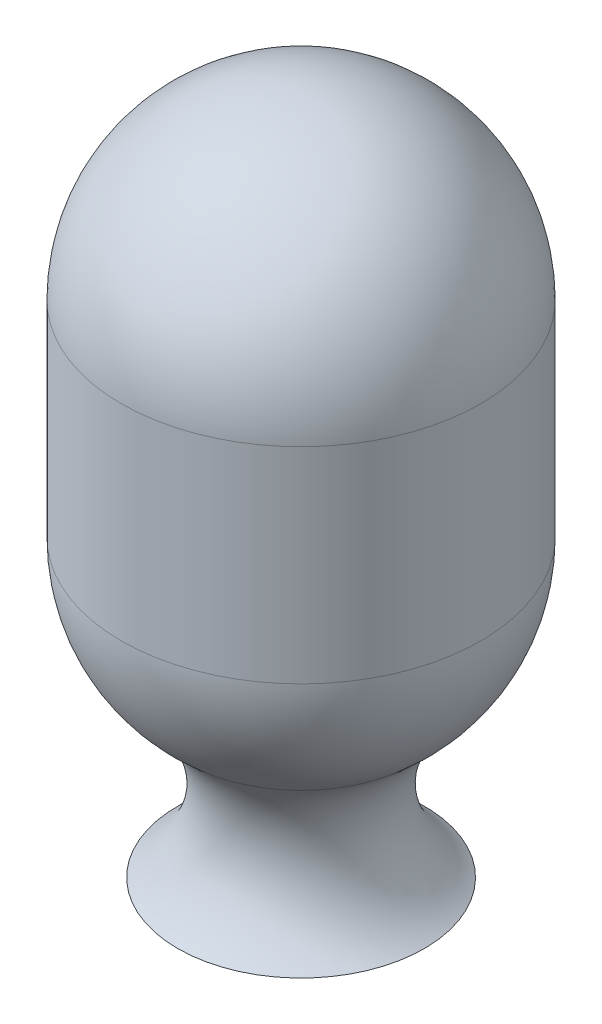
ISO-10303-21;
HEADER;
FILE_DESCRIPTION(('STEP AP214'),'2;1');
FILE_NAME('part.step','',(''),(''),'','','');
FILE_SCHEMA(('AUTOMOTIVE_DESIGN { 1 0 10303 214 1 1 1 1 }'));
ENDSEC;
DATA;
#1=APPLICATION_CONTEXT('core data for automotive mechanical design processes');
#2=APPLICATION_PROTOCOL_DEFINITION('international standard','automotive_design',2000,#1);
#3=PRODUCT_CONTEXT('',#1,'mechanical');
#4=PRODUCT('Part','Part','',(#3));
#5=PRODUCT_RELATED_PRODUCT_CATEGORY('part','',(#4));
#6=PRODUCT_DEFINITION_FORMATION('','',#4);
#7=PRODUCT_DEFINITION_CONTEXT('part definition',#1,'design');
#8=PRODUCT_DEFINITION('design','',#6,#7);
#9=PRODUCT_DEFINITION_SHAPE('','',#8);
#10=(LENGTH_UNIT() NAMED_UNIT(*) SI_UNIT(.MILLI.,.METRE.));
#11=(NAMED_UNIT(*) PLANE_ANGLE_UNIT() SI_UNIT($,.RADIAN.));
#12=(NAMED_UNIT(*) SI_UNIT($,.STERADIAN.) SOLID_ANGLE_UNIT());
#13=UNCERTAINTY_MEASURE_WITH_UNIT(LENGTH_MEASURE(1.E-05),#10,'distance_accuracy_value','');
#14=(GEOMETRIC_REPRESENTATION_CONTEXT(3) GLOBAL_UNCERTAINTY_ASSIGNED_CONTEXT((#13)) GLOBAL_UNIT_ASSIGNED_CONTEXT((#10,
#11,#12)) REPRESENTATION_CONTEXT('',''));
#15=CARTESIAN_POINT('',(0.,0.,0.));
#16=DIRECTION('',(0.,0.,1.));
#17=DIRECTION('',(1.,0.,0.));
#18=AXIS2_PLACEMENT_3D('',#15,#16,#17);
#19=CARTESIAN_POINT('',(18.0000092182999,17.3657061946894,0.));
#20=DIRECTION('',(0.,1.,0.));
#21=DIRECTION('',(0.,0.,1.));
#22=AXIS2_PLACEMENT_3D('',#19,#20,#21);
#23=TOROIDAL_SURFACE('',#22,7.20000000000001,3.96888370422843);
#24=CARTESIAN_POINT('',(18.0000092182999,20.3998361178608,0.));
#25=DIRECTION('',(0.,-1.,0.));
#26=DIRECTION('',(0.,0.,-1.));
#27=AXIS2_PLACEMENT_3D('',#24,#25,#26);
#28=CIRCLE('',#27,4.64146653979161);
#29=CARTESIAN_POINT('',(18.0000092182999,20.3998361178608,-4.64146653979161));
#30=VERTEX_POINT('',#29);
#31=EDGE_CURVE('E58',#30,#30,#28,.T.);
#32=ORIENTED_EDGE('',*,*,#31,.T.);
#33=EDGE_LOOP('',(#32));
#34=FACE_BOUND('',#33,.T.);
#35=CARTESIAN_POINT('',(18.0000092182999,14.1011308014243,0.));
#36=DIRECTION('',(0.,1.,0.));
#37=DIRECTION('',(0.,0.,1.));
#38=AXIS2_PLACEMENT_3D('',#35,#36,#37);
#39=CIRCLE('',#38,4.94288118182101);
#40=CARTESIAN_POINT('',(18.0000092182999,14.1011308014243,4.94288118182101));
#41=VERTEX_POINT('',#40);
#42=EDGE_CURVE('E68',#41,#41,#39,.T.);
#43=ORIENTED_EDGE('',*,*,#42,.T.);
#44=EDGE_LOOP('',(#43));
#45=FACE_BOUND('',#44,.T.);
#46=ADVANCED_FACE('F46',(#34,#45),#23,.F.);
#47=CARTESIAN_POINT('',(18.0000092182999,41.3345898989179,0.));
#48=DIRECTION('',(0.,1.,0.));
#49=DIRECTION('',(0.,0.,1.));
#50=AXIS2_PLACEMENT_3D('',#47,#48,#49);
#51=CYLINDRICAL_SURFACE('',#50,7.20000000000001);
#52=CARTESIAN_POINT('',(18.0000092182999,25.9040879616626,0.));
#53=DIRECTION('',(0.,1.,0.));
#54=DIRECTION('',(0.,0.,1.));
#55=AXIS2_PLACEMENT_3D('',#52,#53,#54);
#56=CIRCLE('',#55,7.20000000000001);
#57=CARTESIAN_POINT('',(18.0000092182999,25.9040879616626,7.20000000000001));
#58=VERTEX_POINT('',#57);
#59=EDGE_CURVE('E62',#58,#58,#56,.T.);
#60=ORIENTED_EDGE('',*,*,#59,.T.);
#61=EDGE_LOOP('',(#60));
#62=FACE_BOUND('',#61,.T.);
#63=CARTESIAN_POINT('',(18.0000092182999,34.1345898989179,0.));
#64=DIRECTION('',(0.,1.,0.));
#65=DIRECTION('',(0.,0.,1.));
#66=AXIS2_PLACEMENT_3D('',#63,#64,#65);
#67=CIRCLE('',#66,7.20000000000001);
#68=CARTESIAN_POINT('',(18.0000092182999,34.1345898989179,7.20000000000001));
#69=VERTEX_POINT('',#68);
#70=EDGE_CURVE('E65',#69,#69,#67,.F.);
#71=ORIENTED_EDGE('',*,*,#70,.T.);
#72=EDGE_LOOP('',(#71));
#73=FACE_BOUND('',#72,.T.);
#74=ADVANCED_FACE('F76',(#62,#73),#51,.T.);
#75=CARTESIAN_POINT('',(13.0571280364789,14.1011308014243,0.));
#76=DIRECTION('',(0.,-1.,0.));
#77=DIRECTION('',(0.,0.,-1.));
#78=AXIS2_PLACEMENT_3D('',#75,#76,#77);
#79=PLANE('',#78);
#80=ORIENTED_EDGE('',*,*,#42,.F.);
#81=EDGE_LOOP('',(#80));
#82=FACE_BOUND('',#81,.T.);
#83=ADVANCED_FACE('F73',(#82),#79,.T.);
#84=CARTESIAN_POINT('',(18.0000092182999,25.9040879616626,0.));
#85=DIRECTION('',(0.,0.,1.));
#86=DIRECTION('',(1.,0.,0.));
#87=AXIS2_PLACEMENT_3D('',#84,#85,#86);
#88=SPHERICAL_SURFACE('',#87,7.2);
#89=CARTESIAN_POINT('',(18.0000092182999,25.9040879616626,0.));
#90=DIRECTION('',(0.,-1.,0.));
#91=DIRECTION('',(0.,0.,-1.));
#92=AXIS2_PLACEMENT_3D('',#89,#90,#91);
#93=SPHERICAL_SURFACE('',#92,7.2);
#94=ORIENTED_EDGE('',*,*,#31,.F.);
#95=EDGE_LOOP('',(#94));
#96=FACE_BOUND('',#95,.T.);
#97=ORIENTED_EDGE('',*,*,#59,.F.);
#98=EDGE_LOOP('',(#97));
#99=FACE_BOUND('',#98,.T.);
#100=ADVANCED_FACE('F75',(#96,#99),#93,.T.);
#101=CARTESIAN_POINT('',(18.0000092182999,34.1345898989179,0.));
#102=DIRECTION('',(0.,1.,0.));
#103=DIRECTION('',(0.,0.,1.));
#104=AXIS2_PLACEMENT_3D('',#101,#102,#103);
#105=SPHERICAL_SURFACE('',#104,7.2);
#106=ORIENTED_EDGE('',*,*,#70,.F.);
#107=EDGE_LOOP('',(#106));
#108=FACE_BOUND('',#107,.T.);
#109=ADVANCED_FACE('F82',(#108),#105,.T.);
#110=CLOSED_SHELL('',(#46,#74,#83,#100,#109));
#111=CARTESIAN_POINT('',(18.0000092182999,41.3345898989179,0.));
#112=DIRECTION('',(0.,1.,0.));
#113=DIRECTION('',(0.,0.,1.));
#114=AXIS2_PLACEMENT_3D('',#111,#112,#113);
#115=CYLINDRICAL_SURFACE('',#114,3.20000000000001);
#116=CARTESIAN_POINT('',(18.0000092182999,25.9040879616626,0.));
#117=DIRECTION('',(0.,1.,0.));
#118=DIRECTION('',(0.,0.,1.));
#119=AXIS2_PLACEMENT_3D('',#116,#117,#118);
#120=CIRCLE('',#119,3.20000000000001);
#121=CARTESIAN_POINT('',(18.0000092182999,25.9040879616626,3.20000000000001));
#122=VERTEX_POINT('',#121);
#123=EDGE_CURVE('E50',#122,#122,#120,.T.);
#124=ORIENTED_EDGE('',*,*,#123,.F.);
#125=EDGE_LOOP('',(#124));
#126=FACE_BOUND('',#125,.T.);
#127=CARTESIAN_POINT('',(18.0000092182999,34.1345898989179,0.));
#128=DIRECTION('',(0.,1.,0.));
#129=DIRECTION('',(0.,0.,1.));
#130=AXIS2_PLACEMENT_3D('',#127,#128,#129);
#131=CIRCLE('',#130,3.20000000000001);
#132=CARTESIAN_POINT('',(18.0000092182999,34.1345898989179,3.20000000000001));
#133=VERTEX_POINT('',#132);
#134=EDGE_CURVE('E10',#133,#133,#131,.F.);
#135=ORIENTED_EDGE('',*,*,#134,.F.);
#136=EDGE_LOOP('',(#135));
#137=FACE_BOUND('',#136,.T.);
#138=ADVANCED_FACE('F96',(#126,#137),#115,.F.);
#139=CARTESIAN_POINT('',(18.0000092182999,25.9040879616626,0.));
#140=DIRECTION('',(0.,0.,1.));
#141=DIRECTION('',(1.,0.,0.));
#142=AXIS2_PLACEMENT_3D('',#139,#140,#141);
#143=SPHERICAL_SURFACE('',#142,3.2);
#144=CARTESIAN_POINT('',(18.0000092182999,25.9040879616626,0.));
#145=DIRECTION('',(0.,1.,0.));
#146=DIRECTION('',(0.,0.,1.));
#147=AXIS2_PLACEMENT_3D('',#144,#145,#146);
#148=SPHERICAL_SURFACE('',#147,3.2);
#149=ORIENTED_EDGE('',*,*,#123,.T.);
#150=EDGE_LOOP('',(#149));
#151=FACE_BOUND('',#150,.T.);
#152=ADVANCED_FACE('F98',(#151),#148,.F.);
#153=CARTESIAN_POINT('',(18.0000092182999,34.1345898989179,0.));
#154=DIRECTION('',(0.,1.,0.));
#155=DIRECTION('',(0.,0.,1.));
#156=AXIS2_PLACEMENT_3D('',#153,#154,#155);
#157=SPHERICAL_SURFACE('',#156,3.2);
#158=ORIENTED_EDGE('',*,*,#134,.T.);
#159=EDGE_LOOP('',(#158));
#160=FACE_BOUND('',#159,.T.);
#161=ADVANCED_FACE('F48',(#160),#157,.F.);
#162=CLOSED_SHELL('',(#138,#152,#161));
#163=ORIENTED_CLOSED_SHELL('',*,#162,.T.);
#164=BREP_WITH_VOIDS('B2',#110,(#163));
#165=ADVANCED_BREP_SHAPE_REPRESENTATION('',(#18,#164),#14);
#166=SHAPE_DEFINITION_REPRESENTATION(#9,#165);
ENDSEC;
END-ISO-10303-21;
